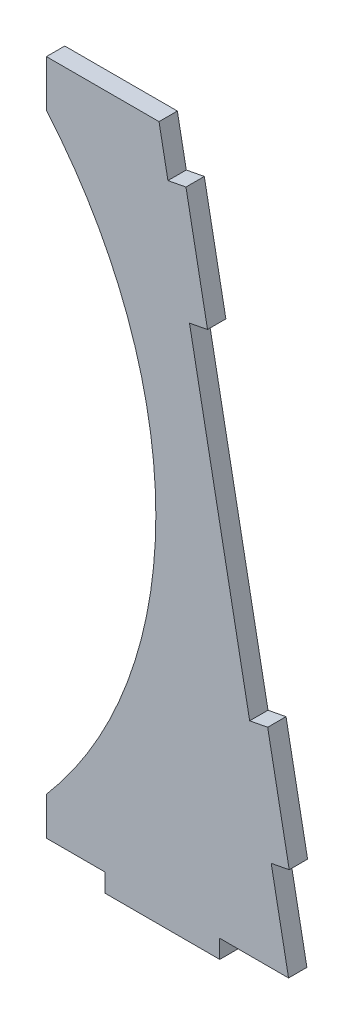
from build123d import *

# Parameters (mm, degrees)
BOSS_EXTRUDE1_DEPTH = 1.524


with BuildPart() as part:
    # Sketch1 → Boss-Extrude1 (new body)
    with BuildSketch(Plane.XY):
        with BuildLine():
            Line((33.443650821, 1.143), (33.443650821, -0.381))
            Line((33.443650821, -0.381), (42.968650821, -0.381))
            Line((42.968650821, -0.381), (42.968650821, 1.143))
            Line((42.968650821, 1.143), (48.684100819, 1.143))
            Line((48.684100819, 1.143), (47.243529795, 8.670574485))
            Line((47.243529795, 8.670574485), (48.740366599, 8.957027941))
            Line((48.740366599, 8.957027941), (46.950032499, 18.312257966))
            Line((46.950032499, 18.312257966), (45.453195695, 18.025804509))
            Line((45.453195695, 18.025804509), (40.456787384, 44.134087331))
            Line((40.456787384, 44.134087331), (41.953624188, 44.420540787))
            Line((41.953624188, 44.420540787), (40.163290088, 53.775770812))
            Line((40.163290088, 53.775770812), (38.666453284, 53.489317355))
            Line((38.666453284, 53.489317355), (37.925510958, 57.361044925))
            Line((37.925510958, 57.361044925), (28.573676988, 57.361044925))
            Line((28.573676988, 57.361044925), (28.573676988, 53.489317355))
            ThreePointArc((28.573676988, 53.489317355), (37.662120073, 28.897365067), (28.573676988, 4.30541278))
            Line((28.573676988, 4.30541278), (28.573676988, 1.143))
            Line((28.573676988, 1.143), (33.443650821, 1.143))
        make_face()
    extrude(amount=BOSS_EXTRUDE1_DEPTH)


solid = part.part
